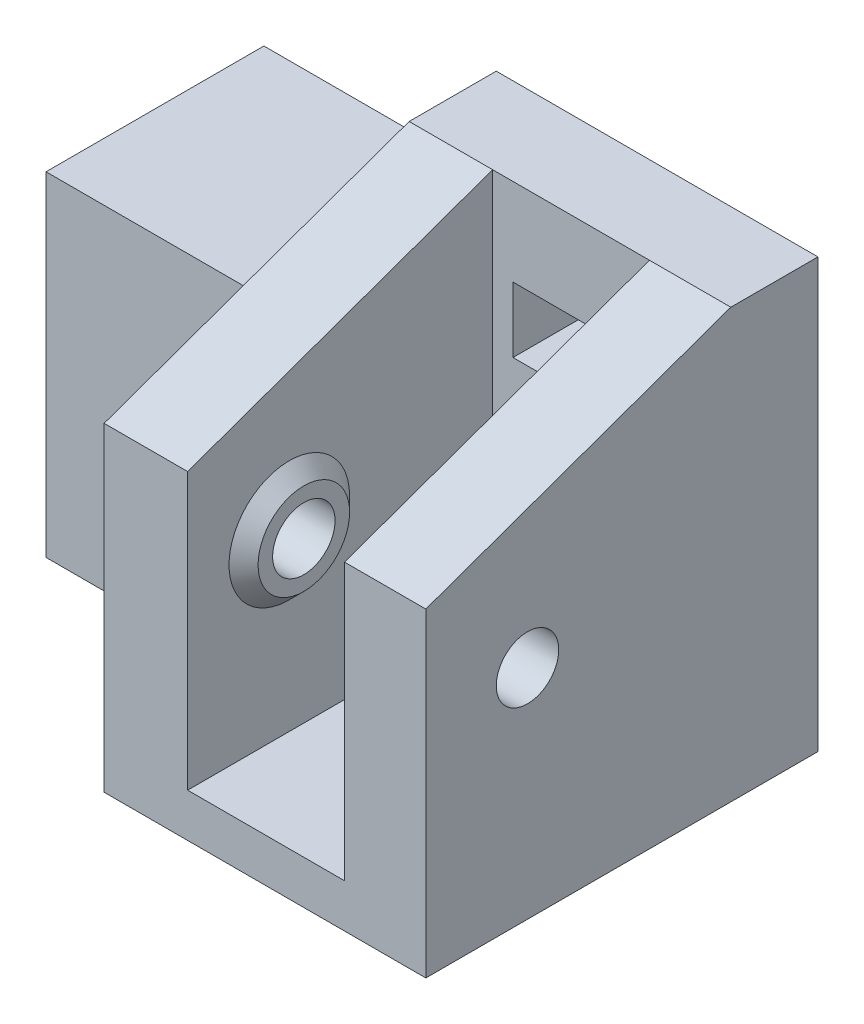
ISO-10303-21;
HEADER;
FILE_DESCRIPTION(('STEP AP214'),'2;1');
FILE_NAME('part.step','',(''),(''),'','','');
FILE_SCHEMA(('AUTOMOTIVE_DESIGN { 1 0 10303 214 1 1 1 1 }'));
ENDSEC;
DATA;
#1=APPLICATION_CONTEXT('core data for automotive mechanical design processes');
#2=APPLICATION_PROTOCOL_DEFINITION('international standard','automotive_design',2000,#1);
#3=PRODUCT_CONTEXT('',#1,'mechanical');
#4=PRODUCT('Part','Part','',(#3));
#5=PRODUCT_RELATED_PRODUCT_CATEGORY('part','',(#4));
#6=PRODUCT_DEFINITION_FORMATION('','',#4);
#7=PRODUCT_DEFINITION_CONTEXT('part definition',#1,'design');
#8=PRODUCT_DEFINITION('design','',#6,#7);
#9=PRODUCT_DEFINITION_SHAPE('','',#8);
#10=(LENGTH_UNIT() NAMED_UNIT(*) SI_UNIT(.MILLI.,.METRE.));
#11=(NAMED_UNIT(*) PLANE_ANGLE_UNIT() SI_UNIT($,.RADIAN.));
#12=(NAMED_UNIT(*) SI_UNIT($,.STERADIAN.) SOLID_ANGLE_UNIT());
#13=UNCERTAINTY_MEASURE_WITH_UNIT(LENGTH_MEASURE(1.E-05),#10,'distance_accuracy_value','');
#14=(GEOMETRIC_REPRESENTATION_CONTEXT(3) GLOBAL_UNCERTAINTY_ASSIGNED_CONTEXT((#13)) GLOBAL_UNIT_ASSIGNED_CONTEXT((#10,
#11,#12)) REPRESENTATION_CONTEXT('',''));
#15=CARTESIAN_POINT('',(0.,0.,0.));
#16=DIRECTION('',(0.,0.,1.));
#17=DIRECTION('',(1.,0.,0.));
#18=AXIS2_PLACEMENT_3D('',#15,#16,#17);
#19=CARTESIAN_POINT('',(13.75,0.,-10.));
#20=DIRECTION('',(-1.,0.,0.));
#21=DIRECTION('',(0.,0.,-1.));
#22=AXIS2_PLACEMENT_3D('',#19,#20,#21);
#23=PLANE('',#22);
#24=CARTESIAN_POINT('',(13.75,0.,0.));
#25=DIRECTION('',(1.,0.,0.));
#26=DIRECTION('',(0.,0.,-1.));
#27=AXIS2_PLACEMENT_3D('',#24,#25,#26);
#28=CIRCLE('',#27,4.14999999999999);
#29=CARTESIAN_POINT('',(13.75,0.,-4.14999999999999));
#30=VERTEX_POINT('',#29);
#31=EDGE_CURVE('E47',#30,#30,#28,.T.);
#32=ORIENTED_EDGE('',*,*,#31,.F.);
#33=EDGE_LOOP('',(#32));
#34=FACE_BOUND('',#33,.T.);
#35=DIRECTION('',(0.,1.,0.));
#36=VECTOR('',#35,1.);
#37=CARTESIAN_POINT('',(13.75,-15.,-14.));
#38=LINE('',#37,#36);
#39=CARTESIAN_POINT('',(13.75,-12.,-14.));
#40=VERTEX_POINT('',#39);
#41=CARTESIAN_POINT('',(13.75,14.5,-14.));
#42=VERTEX_POINT('',#41);
#43=EDGE_CURVE('E186',#40,#42,#38,.T.);
#44=ORIENTED_EDGE('',*,*,#43,.T.);
#45=DIRECTION('',(0.,-0.336336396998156,0.941741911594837));
#46=VECTOR('',#45,1.);
#47=CARTESIAN_POINT('',(13.75,14.5,-14.));
#48=LINE('',#47,#46);
#49=CARTESIAN_POINT('',(13.75,7.,7.));
#50=VERTEX_POINT('',#49);
#51=EDGE_CURVE('E340',#42,#50,#48,.T.);
#52=ORIENTED_EDGE('',*,*,#51,.T.);
#53=DIRECTION('',(0.,-1.,0.));
#54=VECTOR('',#53,1.);
#55=CARTESIAN_POINT('',(13.75,7.,7.));
#56=LINE('',#55,#54);
#57=CARTESIAN_POINT('',(13.75,-12.,7.00000000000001));
#58=VERTEX_POINT('',#57);
#59=EDGE_CURVE('E343',#50,#58,#56,.T.);
#60=ORIENTED_EDGE('',*,*,#59,.T.);
#61=DIRECTION('',(0.,0.,1.));
#62=VECTOR('',#61,1.);
#63=CARTESIAN_POINT('',(13.75,-12.,-14.));
#64=LINE('',#63,#62);
#65=EDGE_CURVE('E190',#40,#58,#64,.T.);
#66=ORIENTED_EDGE('',*,*,#65,.F.);
#67=EDGE_LOOP('',(#44,#52,#60,#66));
#68=FACE_BOUND('',#67,.T.);
#69=ADVANCED_FACE('F39',(#34,#68),#23,.F.);
#70=CARTESIAN_POINT('',(24.55,0.,-10.));
#71=DIRECTION('',(1.,0.,0.));
#72=DIRECTION('',(0.,0.,1.));
#73=AXIS2_PLACEMENT_3D('',#70,#71,#72);
#74=PLANE('',#73);
#75=CARTESIAN_POINT('',(24.55,0.,0.));
#76=DIRECTION('',(-1.,0.,0.));
#77=DIRECTION('',(0.,0.,1.));
#78=AXIS2_PLACEMENT_3D('',#75,#76,#77);
#79=CIRCLE('',#78,4.15);
#80=CARTESIAN_POINT('',(24.55,0.,4.15));
#81=VERTEX_POINT('',#80);
#82=EDGE_CURVE('E11',#81,#81,#79,.T.);
#83=ORIENTED_EDGE('',*,*,#82,.F.);
#84=EDGE_LOOP('',(#83));
#85=FACE_BOUND('',#84,.T.);
#86=DIRECTION('',(0.,1.,0.));
#87=VECTOR('',#86,1.);
#88=CARTESIAN_POINT('',(24.55,7.,7.));
#89=LINE('',#88,#87);
#90=CARTESIAN_POINT('',(24.55,-12.,7.00000000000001));
#91=VERTEX_POINT('',#90);
#92=CARTESIAN_POINT('',(24.55,7.,7.));
#93=VERTEX_POINT('',#92);
#94=EDGE_CURVE('E203',#91,#93,#89,.T.);
#95=ORIENTED_EDGE('',*,*,#94,.T.);
#96=DIRECTION('',(0.,0.336336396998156,-0.941741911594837));
#97=VECTOR('',#96,1.);
#98=CARTESIAN_POINT('',(24.55,14.5,-14.));
#99=LINE('',#98,#97);
#100=CARTESIAN_POINT('',(24.55,14.5,-14.));
#101=VERTEX_POINT('',#100);
#102=EDGE_CURVE('E202',#93,#101,#99,.T.);
#103=ORIENTED_EDGE('',*,*,#102,.T.);
#104=DIRECTION('',(0.,-1.,0.));
#105=VECTOR('',#104,1.);
#106=CARTESIAN_POINT('',(24.55,-15.,-14.));
#107=LINE('',#106,#105);
#108=CARTESIAN_POINT('',(24.55,-12.,-14.));
#109=VERTEX_POINT('',#108);
#110=EDGE_CURVE('E183',#101,#109,#107,.T.);
#111=ORIENTED_EDGE('',*,*,#110,.T.);
#112=DIRECTION('',(0.,0.,-1.));
#113=VECTOR('',#112,1.);
#114=CARTESIAN_POINT('',(24.55,-12.,-14.));
#115=LINE('',#114,#113);
#116=EDGE_CURVE('E191',#91,#109,#115,.T.);
#117=ORIENTED_EDGE('',*,*,#116,.F.);
#118=EDGE_LOOP('',(#95,#103,#111,#117));
#119=FACE_BOUND('',#118,.T.);
#120=ADVANCED_FACE('F200',(#85,#119),#74,.F.);
#121=CARTESIAN_POINT('',(0.,0.,-14.));
#122=DIRECTION('',(0.,0.,1.));
#123=DIRECTION('',(-1.,0.,0.));
#124=AXIS2_PLACEMENT_3D('',#121,#122,#123);
#125=PLANE('',#124);
#126=DIRECTION('',(-1.,0.,0.));
#127=VECTOR('',#126,1.);
#128=CARTESIAN_POINT('',(24.55,-12.,-14.));
#129=LINE('',#128,#127);
#130=EDGE_CURVE('E177',#109,#40,#129,.T.);
#131=ORIENTED_EDGE('',*,*,#130,.F.);
#132=ORIENTED_EDGE('',*,*,#110,.F.);
#133=DIRECTION('',(-1.,0.,0.));
#134=VECTOR('',#133,1.);
#135=CARTESIAN_POINT('',(8.,14.5,-14.));
#136=LINE('',#135,#134);
#137=EDGE_CURVE('E289',#101,#42,#136,.T.);
#138=ORIENTED_EDGE('',*,*,#137,.T.);
#139=ORIENTED_EDGE('',*,*,#43,.F.);
#140=EDGE_LOOP('',(#131,#132,#138,#139));
#141=FACE_BOUND('',#140,.T.);
#142=DIRECTION('',(0.,-1.,0.));
#143=VECTOR('',#142,1.);
#144=CARTESIAN_POINT('',(15.15,-4.,-14.));
#145=LINE('',#144,#143);
#146=CARTESIAN_POINT('',(15.15,-4.,-14.));
#147=VERTEX_POINT('',#146);
#148=CARTESIAN_POINT('',(15.15,-8.5,-14.));
#149=VERTEX_POINT('',#148);
#150=EDGE_CURVE('E222',#147,#149,#145,.T.);
#151=ORIENTED_EDGE('',*,*,#150,.F.);
#152=DIRECTION('',(-1.,0.,0.));
#153=VECTOR('',#152,1.);
#154=CARTESIAN_POINT('',(15.15,-4.,-14.));
#155=LINE('',#154,#153);
#156=CARTESIAN_POINT('',(23.15,-4.,-14.));
#157=VERTEX_POINT('',#156);
#158=EDGE_CURVE('E232',#157,#147,#155,.T.);
#159=ORIENTED_EDGE('',*,*,#158,.F.);
#160=DIRECTION('',(0.,1.,0.));
#161=VECTOR('',#160,1.);
#162=CARTESIAN_POINT('',(23.15,-4.,-14.));
#163=LINE('',#162,#161);
#164=CARTESIAN_POINT('',(23.15,-8.5,-14.));
#165=VERTEX_POINT('',#164);
#166=EDGE_CURVE('E229',#165,#157,#163,.T.);
#167=ORIENTED_EDGE('',*,*,#166,.F.);
#168=DIRECTION('',(1.,0.,0.));
#169=VECTOR('',#168,1.);
#170=CARTESIAN_POINT('',(15.15,-8.5,-14.));
#171=LINE('',#170,#169);
#172=EDGE_CURVE('E225',#149,#165,#171,.T.);
#173=ORIENTED_EDGE('',*,*,#172,.F.);
#174=EDGE_LOOP('',(#151,#159,#167,#173));
#175=FACE_BOUND('',#174,.T.);
#176=DIRECTION('',(0.,-1.,0.));
#177=VECTOR('',#176,1.);
#178=CARTESIAN_POINT('',(15.15,4.,-14.));
#179=LINE('',#178,#177);
#180=CARTESIAN_POINT('',(15.15,8.5,-14.));
#181=VERTEX_POINT('',#180);
#182=CARTESIAN_POINT('',(15.15,4.,-14.));
#183=VERTEX_POINT('',#182);
#184=EDGE_CURVE('E254',#181,#183,#179,.T.);
#185=ORIENTED_EDGE('',*,*,#184,.F.);
#186=DIRECTION('',(-1.,0.,0.));
#187=VECTOR('',#186,1.);
#188=CARTESIAN_POINT('',(15.15,8.5,-14.));
#189=LINE('',#188,#187);
#190=CARTESIAN_POINT('',(23.15,8.5,-14.));
#191=VERTEX_POINT('',#190);
#192=EDGE_CURVE('E264',#191,#181,#189,.T.);
#193=ORIENTED_EDGE('',*,*,#192,.F.);
#194=DIRECTION('',(0.,1.,0.));
#195=VECTOR('',#194,1.);
#196=CARTESIAN_POINT('',(23.15,4.,-14.));
#197=LINE('',#196,#195);
#198=CARTESIAN_POINT('',(23.15,4.,-14.));
#199=VERTEX_POINT('',#198);
#200=EDGE_CURVE('E261',#199,#191,#197,.T.);
#201=ORIENTED_EDGE('',*,*,#200,.F.);
#202=DIRECTION('',(1.,0.,0.));
#203=VECTOR('',#202,1.);
#204=CARTESIAN_POINT('',(15.15,4.,-14.));
#205=LINE('',#204,#203);
#206=EDGE_CURVE('E257',#183,#199,#205,.T.);
#207=ORIENTED_EDGE('',*,*,#206,.F.);
#208=EDGE_LOOP('',(#185,#193,#201,#207));
#209=FACE_BOUND('',#208,.T.);
#210=ADVANCED_FACE('F179',(#141,#175,#209),#125,.T.);
#211=CARTESIAN_POINT('',(0.,0.,-20.));
#212=DIRECTION('',(0.,0.,1.));
#213=DIRECTION('',(-1.,0.,0.));
#214=AXIS2_PLACEMENT_3D('',#211,#212,#213);
#215=PLANE('',#214);
#216=DIRECTION('',(1.,0.,0.));
#217=VECTOR('',#216,1.);
#218=CARTESIAN_POINT('',(8.,-15.,-20.));
#219=LINE('',#218,#217);
#220=CARTESIAN_POINT('',(-8.,-15.,-20.));
#221=VERTEX_POINT('',#220);
#222=CARTESIAN_POINT('',(30.15,-15.,-20.));
#223=VERTEX_POINT('',#222);
#224=EDGE_CURVE('E322',#221,#223,#219,.T.);
#225=ORIENTED_EDGE('',*,*,#224,.F.);
#226=DIRECTION('',(0.,-1.,0.));
#227=VECTOR('',#226,1.);
#228=CARTESIAN_POINT('',(-8.,8.,-20.));
#229=LINE('',#228,#227);
#230=CARTESIAN_POINT('',(-8.,8.,-20.));
#231=VERTEX_POINT('',#230);
#232=EDGE_CURVE('E320',#231,#221,#229,.T.);
#233=ORIENTED_EDGE('',*,*,#232,.F.);
#234=DIRECTION('',(-1.,0.,0.));
#235=VECTOR('',#234,1.);
#236=CARTESIAN_POINT('',(8.,8.,-20.));
#237=LINE('',#236,#235);
#238=CARTESIAN_POINT('',(8.,7.99999999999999,-20.));
#239=VERTEX_POINT('',#238);
#240=EDGE_CURVE('E316',#239,#231,#237,.T.);
#241=ORIENTED_EDGE('',*,*,#240,.F.);
#242=DIRECTION('',(0.,-1.,0.));
#243=VECTOR('',#242,1.);
#244=CARTESIAN_POINT('',(8.,-15.,-20.));
#245=LINE('',#244,#243);
#246=CARTESIAN_POINT('',(8.,14.5,-20.));
#247=VERTEX_POINT('',#246);
#248=EDGE_CURVE('E280',#247,#239,#245,.T.);
#249=ORIENTED_EDGE('',*,*,#248,.F.);
#250=DIRECTION('',(-1.,0.,0.));
#251=VECTOR('',#250,1.);
#252=CARTESIAN_POINT('',(8.,14.5,-20.));
#253=LINE('',#252,#251);
#254=CARTESIAN_POINT('',(30.15,14.5,-20.));
#255=VERTEX_POINT('',#254);
#256=EDGE_CURVE('E295',#255,#247,#253,.T.);
#257=ORIENTED_EDGE('',*,*,#256,.F.);
#258=DIRECTION('',(0.,1.,0.));
#259=VECTOR('',#258,1.);
#260=CARTESIAN_POINT('',(30.15,-15.,-20.));
#261=LINE('',#260,#259);
#262=EDGE_CURVE('E292',#223,#255,#261,.T.);
#263=ORIENTED_EDGE('',*,*,#262,.F.);
#264=EDGE_LOOP('',(#225,#233,#241,#249,#257,#263));
#265=FACE_BOUND('',#264,.T.);
#266=CARTESIAN_POINT('',(0.,0.,-20.));
#267=DIRECTION('',(0.,0.,1.));
#268=DIRECTION('',(1.,0.,0.));
#269=AXIS2_PLACEMENT_3D('',#266,#267,#268);
#270=CIRCLE('',#269,4.);
#271=CARTESIAN_POINT('',(4.,0.,-20.));
#272=VERTEX_POINT('',#271);
#273=EDGE_CURVE('E313',#272,#272,#270,.T.);
#274=ORIENTED_EDGE('',*,*,#273,.T.);
#275=EDGE_LOOP('',(#274));
#276=FACE_BOUND('',#275,.T.);
#277=DIRECTION('',(1.,0.,0.));
#278=VECTOR('',#277,1.);
#279=CARTESIAN_POINT('',(15.15,-8.5,-20.));
#280=LINE('',#279,#278);
#281=CARTESIAN_POINT('',(15.15,-8.5,-20.));
#282=VERTEX_POINT('',#281);
#283=CARTESIAN_POINT('',(23.15,-8.5,-20.));
#284=VERTEX_POINT('',#283);
#285=EDGE_CURVE('E238',#282,#284,#280,.T.);
#286=ORIENTED_EDGE('',*,*,#285,.T.);
#287=DIRECTION('',(0.,1.,0.));
#288=VECTOR('',#287,1.);
#289=CARTESIAN_POINT('',(23.15,-4.,-20.));
#290=LINE('',#289,#288);
#291=CARTESIAN_POINT('',(23.15,-4.,-20.));
#292=VERTEX_POINT('',#291);
#293=EDGE_CURVE('E241',#284,#292,#290,.T.);
#294=ORIENTED_EDGE('',*,*,#293,.T.);
#295=DIRECTION('',(-1.,0.,0.));
#296=VECTOR('',#295,1.);
#297=CARTESIAN_POINT('',(15.15,-4.,-20.));
#298=LINE('',#297,#296);
#299=CARTESIAN_POINT('',(15.15,-4.,-20.));
#300=VERTEX_POINT('',#299);
#301=EDGE_CURVE('E226',#292,#300,#298,.T.);
#302=ORIENTED_EDGE('',*,*,#301,.T.);
#303=DIRECTION('',(0.,-1.,0.));
#304=VECTOR('',#303,1.);
#305=CARTESIAN_POINT('',(15.15,-4.,-20.));
#306=LINE('',#305,#304);
#307=EDGE_CURVE('E219',#300,#282,#306,.T.);
#308=ORIENTED_EDGE('',*,*,#307,.T.);
#309=EDGE_LOOP('',(#286,#294,#302,#308));
#310=FACE_BOUND('',#309,.T.);
#311=DIRECTION('',(1.,0.,0.));
#312=VECTOR('',#311,1.);
#313=CARTESIAN_POINT('',(15.15,4.,-20.));
#314=LINE('',#313,#312);
#315=CARTESIAN_POINT('',(15.15,4.,-20.));
#316=VERTEX_POINT('',#315);
#317=CARTESIAN_POINT('',(23.15,4.,-20.));
#318=VERTEX_POINT('',#317);
#319=EDGE_CURVE('E270',#316,#318,#314,.T.);
#320=ORIENTED_EDGE('',*,*,#319,.T.);
#321=DIRECTION('',(0.,1.,0.));
#322=VECTOR('',#321,1.);
#323=CARTESIAN_POINT('',(23.15,4.,-20.));
#324=LINE('',#323,#322);
#325=CARTESIAN_POINT('',(23.15,8.5,-20.));
#326=VERTEX_POINT('',#325);
#327=EDGE_CURVE('E273',#318,#326,#324,.T.);
#328=ORIENTED_EDGE('',*,*,#327,.T.);
#329=DIRECTION('',(-1.,0.,0.));
#330=VECTOR('',#329,1.);
#331=CARTESIAN_POINT('',(15.15,8.5,-20.));
#332=LINE('',#331,#330);
#333=CARTESIAN_POINT('',(15.15,8.5,-20.));
#334=VERTEX_POINT('',#333);
#335=EDGE_CURVE('E258',#326,#334,#332,.T.);
#336=ORIENTED_EDGE('',*,*,#335,.T.);
#337=DIRECTION('',(0.,-1.,0.));
#338=VECTOR('',#337,1.);
#339=CARTESIAN_POINT('',(15.15,4.,-20.));
#340=LINE('',#339,#338);
#341=EDGE_CURVE('E248',#334,#316,#340,.T.);
#342=ORIENTED_EDGE('',*,*,#341,.T.);
#343=EDGE_LOOP('',(#320,#328,#336,#342));
#344=FACE_BOUND('',#343,.T.);
#345=ADVANCED_FACE('F394',(#265,#276,#310,#344),#215,.F.);
#346=CARTESIAN_POINT('',(8.,8.,-20.));
#347=DIRECTION('',(0.,-1.,0.));
#348=DIRECTION('',(0.,0.,1.));
#349=AXIS2_PLACEMENT_3D('',#346,#347,#348);
#350=PLANE('',#349);
#351=DIRECTION('',(0.,0.,1.));
#352=VECTOR('',#351,1.);
#353=CARTESIAN_POINT('',(8.,8.,-20.));
#354=LINE('',#353,#352);
#355=CARTESIAN_POINT('',(8.,8.,-5.));
#356=VERTEX_POINT('',#355);
#357=EDGE_CURVE('E326',#239,#356,#354,.T.);
#358=ORIENTED_EDGE('',*,*,#357,.F.);
#359=ORIENTED_EDGE('',*,*,#240,.T.);
#360=DIRECTION('',(0.,0.,1.));
#361=VECTOR('',#360,1.);
#362=CARTESIAN_POINT('',(-8.,8.,-20.));
#363=LINE('',#362,#361);
#364=CARTESIAN_POINT('',(-8.,8.,-5.));
#365=VERTEX_POINT('',#364);
#366=EDGE_CURVE('E61',#231,#365,#363,.T.);
#367=ORIENTED_EDGE('',*,*,#366,.T.);
#368=DIRECTION('',(1.,0.,0.));
#369=VECTOR('',#368,1.);
#370=CARTESIAN_POINT('',(-8.,8.,-5.));
#371=LINE('',#370,#369);
#372=EDGE_CURVE('E300',#365,#356,#371,.T.);
#373=ORIENTED_EDGE('',*,*,#372,.T.);
#374=EDGE_LOOP('',(#358,#359,#367,#373));
#375=FACE_BOUND('',#374,.T.);
#376=ADVANCED_FACE('F497',(#375),#350,.F.);
#377=CARTESIAN_POINT('',(-8.,8.,-20.));
#378=DIRECTION('',(1.,0.,0.));
#379=DIRECTION('',(0.,1.,0.));
#380=AXIS2_PLACEMENT_3D('',#377,#378,#379);
#381=PLANE('',#380);
#382=ORIENTED_EDGE('',*,*,#366,.F.);
#383=ORIENTED_EDGE('',*,*,#232,.T.);
#384=DIRECTION('',(0.,0.,1.));
#385=VECTOR('',#384,1.);
#386=CARTESIAN_POINT('',(-8.,-15.,-20.));
#387=LINE('',#386,#385);
#388=CARTESIAN_POINT('',(-8.,-15.,-5.));
#389=VERTEX_POINT('',#388);
#390=EDGE_CURVE('E54',#221,#389,#387,.T.);
#391=ORIENTED_EDGE('',*,*,#390,.T.);
#392=DIRECTION('',(0.,1.,0.));
#393=VECTOR('',#392,1.);
#394=CARTESIAN_POINT('',(-8.,-15.,-5.));
#395=LINE('',#394,#393);
#396=EDGE_CURVE('E310',#389,#365,#395,.T.);
#397=ORIENTED_EDGE('',*,*,#396,.T.);
#398=EDGE_LOOP('',(#382,#383,#391,#397));
#399=FACE_BOUND('',#398,.T.);
#400=ADVANCED_FACE('F500',(#399),#381,.F.);
#401=CARTESIAN_POINT('',(8.,-15.,-20.));
#402=DIRECTION('',(0.,1.,0.));
#403=DIRECTION('',(0.,0.,-1.));
#404=AXIS2_PLACEMENT_3D('',#401,#402,#403);
#405=PLANE('',#404);
#406=DIRECTION('',(0.,0.,-1.));
#407=VECTOR('',#406,1.);
#408=CARTESIAN_POINT('',(8.,-15.,7.00000000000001));
#409=LINE('',#408,#407);
#410=CARTESIAN_POINT('',(8.,-15.,7.00000000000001));
#411=VERTEX_POINT('',#410);
#412=CARTESIAN_POINT('',(8.,-15.,-5.));
#413=VERTEX_POINT('',#412);
#414=EDGE_CURVE('E341',#411,#413,#409,.T.);
#415=ORIENTED_EDGE('',*,*,#414,.T.);
#416=DIRECTION('',(-1.,0.,0.));
#417=VECTOR('',#416,1.);
#418=CARTESIAN_POINT('',(8.,-15.,-5.));
#419=LINE('',#418,#417);
#420=EDGE_CURVE('E308',#413,#389,#419,.T.);
#421=ORIENTED_EDGE('',*,*,#420,.T.);
#422=ORIENTED_EDGE('',*,*,#390,.F.);
#423=ORIENTED_EDGE('',*,*,#224,.T.);
#424=DIRECTION('',(0.,0.,-1.));
#425=VECTOR('',#424,1.);
#426=CARTESIAN_POINT('',(30.15,-15.,-14.));
#427=LINE('',#426,#425);
#428=CARTESIAN_POINT('',(30.15,-15.,7.00000000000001));
#429=VERTEX_POINT('',#428);
#430=EDGE_CURVE('E288',#429,#223,#427,.T.);
#431=ORIENTED_EDGE('',*,*,#430,.F.);
#432=DIRECTION('',(1.,0.,0.));
#433=VECTOR('',#432,1.);
#434=CARTESIAN_POINT('',(24.55,-15.,7.00000000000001));
#435=LINE('',#434,#433);
#436=EDGE_CURVE('E214',#411,#429,#435,.T.);
#437=ORIENTED_EDGE('',*,*,#436,.F.);
#438=EDGE_LOOP('',(#415,#421,#422,#423,#431,#437));
#439=FACE_BOUND('',#438,.T.);
#440=ADVANCED_FACE('F384',(#439),#405,.F.);
#441=CARTESIAN_POINT('',(0.,0.,-20.));
#442=DIRECTION('',(0.,0.,1.));
#443=DIRECTION('',(-1.,0.,0.));
#444=AXIS2_PLACEMENT_3D('',#441,#442,#443);
#445=CYLINDRICAL_SURFACE('',#444,4.);
#446=ORIENTED_EDGE('',*,*,#273,.F.);
#447=EDGE_LOOP('',(#446));
#448=FACE_BOUND('',#447,.T.);
#449=CARTESIAN_POINT('',(0.,0.,-10.));
#450=DIRECTION('',(0.,0.,1.));
#451=DIRECTION('',(1.,0.,0.));
#452=AXIS2_PLACEMENT_3D('',#449,#450,#451);
#453=CIRCLE('',#452,4.);
#454=CARTESIAN_POINT('',(4.,0.,-10.));
#455=VERTEX_POINT('',#454);
#456=EDGE_CURVE('E312',#455,#455,#453,.T.);
#457=ORIENTED_EDGE('',*,*,#456,.T.);
#458=EDGE_LOOP('',(#457));
#459=FACE_BOUND('',#458,.T.);
#460=ADVANCED_FACE('F490',(#448,#459),#445,.F.);
#461=CARTESIAN_POINT('',(0.,0.,-10.));
#462=DIRECTION('',(0.,0.,1.));
#463=DIRECTION('',(-1.,0.,0.));
#464=AXIS2_PLACEMENT_3D('',#461,#462,#463);
#465=PLANE('',#464);
#466=ORIENTED_EDGE('',*,*,#456,.F.);
#467=EDGE_LOOP('',(#466));
#468=FACE_BOUND('',#467,.T.);
#469=ADVANCED_FACE('F486',(#468),#465,.F.);
#470=CARTESIAN_POINT('',(0.,0.,-5.));
#471=DIRECTION('',(0.,0.,1.));
#472=DIRECTION('',(-1.,0.,0.));
#473=AXIS2_PLACEMENT_3D('',#470,#471,#472);
#474=PLANE('',#473);
#475=ORIENTED_EDGE('',*,*,#372,.F.);
#476=ORIENTED_EDGE('',*,*,#396,.F.);
#477=ORIENTED_EDGE('',*,*,#420,.F.);
#478=DIRECTION('',(0.,-1.,0.));
#479=VECTOR('',#478,1.);
#480=CARTESIAN_POINT('',(8.,8.,-5.));
#481=LINE('',#480,#479);
#482=EDGE_CURVE('E306',#356,#413,#481,.T.);
#483=ORIENTED_EDGE('',*,*,#482,.F.);
#484=EDGE_LOOP('',(#475,#476,#477,#483));
#485=FACE_BOUND('',#484,.T.);
#486=ADVANCED_FACE('F483',(#485),#474,.T.);
#487=CARTESIAN_POINT('',(8.,-15.,-14.));
#488=DIRECTION('',(-1.,0.,0.));
#489=DIRECTION('',(0.,0.,-1.));
#490=AXIS2_PLACEMENT_3D('',#487,#488,#489);
#491=PLANE('',#490);
#492=ORIENTED_EDGE('',*,*,#357,.T.);
#493=ORIENTED_EDGE('',*,*,#482,.T.);
#494=ORIENTED_EDGE('',*,*,#414,.F.);
#495=DIRECTION('',(0.,-1.,0.));
#496=VECTOR('',#495,1.);
#497=CARTESIAN_POINT('',(8.,6.99999999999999,7.));
#498=LINE('',#497,#496);
#499=CARTESIAN_POINT('',(7.99999999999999,7.,7.));
#500=VERTEX_POINT('',#499);
#501=EDGE_CURVE('E356',#500,#411,#498,.T.);
#502=ORIENTED_EDGE('',*,*,#501,.F.);
#503=DIRECTION('',(0.,-0.336336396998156,0.941741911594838));
#504=VECTOR('',#503,1.);
#505=CARTESIAN_POINT('',(8.,14.5,-14.));
#506=LINE('',#505,#504);
#507=CARTESIAN_POINT('',(8.,14.5,-14.));
#508=VERTEX_POINT('',#507);
#509=EDGE_CURVE('E346',#508,#500,#506,.T.);
#510=ORIENTED_EDGE('',*,*,#509,.F.);
#511=DIRECTION('',(0.,0.,-1.));
#512=VECTOR('',#511,1.);
#513=CARTESIAN_POINT('',(8.,14.5,-14.));
#514=LINE('',#513,#512);
#515=EDGE_CURVE('E298',#508,#247,#514,.T.);
#516=ORIENTED_EDGE('',*,*,#515,.T.);
#517=ORIENTED_EDGE('',*,*,#248,.T.);
#518=EDGE_LOOP('',(#492,#493,#494,#502,#510,#516,#517));
#519=FACE_BOUND('',#518,.T.);
#520=CARTESIAN_POINT('',(8.,0.,0.));
#521=DIRECTION('',(1.,0.,0.));
#522=DIRECTION('',(0.,-1.,0.));
#523=AXIS2_PLACEMENT_3D('',#520,#521,#522);
#524=CIRCLE('',#523,2.15);
#525=CARTESIAN_POINT('',(7.99999999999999,0.,2.15));
#526=VERTEX_POINT('',#525);
#527=EDGE_CURVE('E354',#526,#526,#524,.T.);
#528=ORIENTED_EDGE('',*,*,#527,.T.);
#529=EDGE_LOOP('',(#528));
#530=FACE_BOUND('',#529,.T.);
#531=ADVANCED_FACE('F379',(#519,#530),#491,.T.);
#532=CARTESIAN_POINT('',(8.,14.5,-14.));
#533=DIRECTION('',(0.,1.,0.));
#534=DIRECTION('',(0.,0.,-1.));
#535=AXIS2_PLACEMENT_3D('',#532,#533,#534);
#536=PLANE('',#535);
#537=ORIENTED_EDGE('',*,*,#256,.T.);
#538=ORIENTED_EDGE('',*,*,#515,.F.);
#539=DIRECTION('',(1.,0.,0.));
#540=VECTOR('',#539,1.);
#541=CARTESIAN_POINT('',(-28.2111861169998,14.5,-14.));
#542=LINE('',#541,#540);
#543=EDGE_CURVE('E353',#508,#42,#542,.T.);
#544=ORIENTED_EDGE('',*,*,#543,.T.);
#545=ORIENTED_EDGE('',*,*,#137,.F.);
#546=CARTESIAN_POINT('',(30.15,14.5,-14.));
#547=VERTEX_POINT('',#546);
#548=EDGE_CURVE('E286',#547,#101,#136,.T.);
#549=ORIENTED_EDGE('',*,*,#548,.F.);
#550=DIRECTION('',(0.,0.,-1.));
#551=VECTOR('',#550,1.);
#552=CARTESIAN_POINT('',(30.15,14.5,-14.));
#553=LINE('',#552,#551);
#554=EDGE_CURVE('E301',#547,#255,#553,.T.);
#555=ORIENTED_EDGE('',*,*,#554,.T.);
#556=EDGE_LOOP('',(#537,#538,#544,#545,#549,#555));
#557=FACE_BOUND('',#556,.T.);
#558=ADVANCED_FACE('F400',(#557),#536,.T.);
#559=CARTESIAN_POINT('',(30.15,-15.,-14.));
#560=DIRECTION('',(1.,0.,0.));
#561=DIRECTION('',(0.,0.,1.));
#562=AXIS2_PLACEMENT_3D('',#559,#560,#561);
#563=PLANE('',#562);
#564=ORIENTED_EDGE('',*,*,#262,.T.);
#565=ORIENTED_EDGE('',*,*,#554,.F.);
#566=DIRECTION('',(0.,0.336336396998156,-0.941741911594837));
#567=VECTOR('',#566,1.);
#568=CARTESIAN_POINT('',(30.15,14.5,-14.));
#569=LINE('',#568,#567);
#570=CARTESIAN_POINT('',(30.15,7.,7.));
#571=VERTEX_POINT('',#570);
#572=EDGE_CURVE('E204',#571,#547,#569,.T.);
#573=ORIENTED_EDGE('',*,*,#572,.F.);
#574=DIRECTION('',(0.,1.,0.));
#575=VECTOR('',#574,1.);
#576=CARTESIAN_POINT('',(30.15,7.,7.));
#577=LINE('',#576,#575);
#578=EDGE_CURVE('E207',#429,#571,#577,.T.);
#579=ORIENTED_EDGE('',*,*,#578,.F.);
#580=ORIENTED_EDGE('',*,*,#430,.T.);
#581=EDGE_LOOP('',(#564,#565,#573,#579,#580));
#582=FACE_BOUND('',#581,.T.);
#583=CARTESIAN_POINT('',(30.15,0.,0.));
#584=DIRECTION('',(-1.,0.,0.));
#585=DIRECTION('',(0.,0.,1.));
#586=AXIS2_PLACEMENT_3D('',#583,#584,#585);
#587=CIRCLE('',#586,2.15);
#588=CARTESIAN_POINT('',(30.15,0.,2.15));
#589=VERTEX_POINT('',#588);
#590=EDGE_CURVE('E210',#589,#589,#587,.T.);
#591=ORIENTED_EDGE('',*,*,#590,.T.);
#592=EDGE_LOOP('',(#591));
#593=FACE_BOUND('',#592,.T.);
#594=ADVANCED_FACE('F388',(#582,#593),#563,.T.);
#595=CARTESIAN_POINT('',(15.15,4.,-14.));
#596=DIRECTION('',(-1.,0.,0.));
#597=DIRECTION('',(0.,0.,-1.));
#598=AXIS2_PLACEMENT_3D('',#595,#596,#597);
#599=PLANE('',#598);
#600=ORIENTED_EDGE('',*,*,#341,.F.);
#601=DIRECTION('',(0.,0.,-1.));
#602=VECTOR('',#601,1.);
#603=CARTESIAN_POINT('',(15.15,8.5,-14.));
#604=LINE('',#603,#602);
#605=EDGE_CURVE('E278',#181,#334,#604,.T.);
#606=ORIENTED_EDGE('',*,*,#605,.F.);
#607=ORIENTED_EDGE('',*,*,#184,.T.);
#608=DIRECTION('',(0.,0.,-1.));
#609=VECTOR('',#608,1.);
#610=CARTESIAN_POINT('',(15.15,4.,-14.));
#611=LINE('',#610,#609);
#612=EDGE_CURVE('E267',#183,#316,#611,.T.);
#613=ORIENTED_EDGE('',*,*,#612,.T.);
#614=EDGE_LOOP('',(#600,#606,#607,#613));
#615=FACE_BOUND('',#614,.T.);
#616=ADVANCED_FACE('F464',(#615),#599,.F.);
#617=CARTESIAN_POINT('',(15.15,8.5,-14.));
#618=DIRECTION('',(0.,1.,0.));
#619=DIRECTION('',(0.,0.,-1.));
#620=AXIS2_PLACEMENT_3D('',#617,#618,#619);
#621=PLANE('',#620);
#622=ORIENTED_EDGE('',*,*,#335,.F.);
#623=DIRECTION('',(0.,0.,-1.));
#624=VECTOR('',#623,1.);
#625=CARTESIAN_POINT('',(23.15,8.5,-14.));
#626=LINE('',#625,#624);
#627=EDGE_CURVE('E281',#191,#326,#626,.T.);
#628=ORIENTED_EDGE('',*,*,#627,.F.);
#629=ORIENTED_EDGE('',*,*,#192,.T.);
#630=ORIENTED_EDGE('',*,*,#605,.T.);
#631=EDGE_LOOP('',(#622,#628,#629,#630));
#632=FACE_BOUND('',#631,.T.);
#633=ADVANCED_FACE('F460',(#632),#621,.F.);
#634=CARTESIAN_POINT('',(23.15,4.,-14.));
#635=DIRECTION('',(1.,0.,0.));
#636=DIRECTION('',(0.,0.,1.));
#637=AXIS2_PLACEMENT_3D('',#634,#635,#636);
#638=PLANE('',#637);
#639=ORIENTED_EDGE('',*,*,#327,.F.);
#640=DIRECTION('',(0.,0.,-1.));
#641=VECTOR('',#640,1.);
#642=CARTESIAN_POINT('',(23.15,4.,-14.));
#643=LINE('',#642,#641);
#644=EDGE_CURVE('E283',#199,#318,#643,.T.);
#645=ORIENTED_EDGE('',*,*,#644,.F.);
#646=ORIENTED_EDGE('',*,*,#200,.T.);
#647=ORIENTED_EDGE('',*,*,#627,.T.);
#648=EDGE_LOOP('',(#639,#645,#646,#647));
#649=FACE_BOUND('',#648,.T.);
#650=ADVANCED_FACE('F463',(#649),#638,.F.);
#651=CARTESIAN_POINT('',(15.15,4.,-14.));
#652=DIRECTION('',(0.,-1.,0.));
#653=DIRECTION('',(0.,0.,1.));
#654=AXIS2_PLACEMENT_3D('',#651,#652,#653);
#655=PLANE('',#654);
#656=ORIENTED_EDGE('',*,*,#319,.F.);
#657=ORIENTED_EDGE('',*,*,#612,.F.);
#658=ORIENTED_EDGE('',*,*,#206,.T.);
#659=ORIENTED_EDGE('',*,*,#644,.T.);
#660=EDGE_LOOP('',(#656,#657,#658,#659));
#661=FACE_BOUND('',#660,.T.);
#662=ADVANCED_FACE('F458',(#661),#655,.F.);
#663=CARTESIAN_POINT('',(15.15,-4.,-14.));
#664=DIRECTION('',(-1.,0.,0.));
#665=DIRECTION('',(0.,-1.,0.));
#666=AXIS2_PLACEMENT_3D('',#663,#664,#665);
#667=PLANE('',#666);
#668=ORIENTED_EDGE('',*,*,#307,.F.);
#669=DIRECTION('',(0.,0.,-1.));
#670=VECTOR('',#669,1.);
#671=CARTESIAN_POINT('',(15.15,-4.,-14.));
#672=LINE('',#671,#670);
#673=EDGE_CURVE('E246',#147,#300,#672,.T.);
#674=ORIENTED_EDGE('',*,*,#673,.F.);
#675=ORIENTED_EDGE('',*,*,#150,.T.);
#676=DIRECTION('',(0.,0.,-1.));
#677=VECTOR('',#676,1.);
#678=CARTESIAN_POINT('',(15.15,-8.5,-14.));
#679=LINE('',#678,#677);
#680=EDGE_CURVE('E235',#149,#282,#679,.T.);
#681=ORIENTED_EDGE('',*,*,#680,.T.);
#682=EDGE_LOOP('',(#668,#674,#675,#681));
#683=FACE_BOUND('',#682,.T.);
#684=ADVANCED_FACE('F448',(#683),#667,.F.);
#685=CARTESIAN_POINT('',(15.15,-4.,-14.));
#686=DIRECTION('',(0.,1.,0.));
#687=DIRECTION('',(0.,0.,-1.));
#688=AXIS2_PLACEMENT_3D('',#685,#686,#687);
#689=PLANE('',#688);
#690=ORIENTED_EDGE('',*,*,#301,.F.);
#691=DIRECTION('',(0.,0.,-1.));
#692=VECTOR('',#691,1.);
#693=CARTESIAN_POINT('',(23.15,-4.,-14.));
#694=LINE('',#693,#692);
#695=EDGE_CURVE('E249',#157,#292,#694,.T.);
#696=ORIENTED_EDGE('',*,*,#695,.F.);
#697=ORIENTED_EDGE('',*,*,#158,.T.);
#698=ORIENTED_EDGE('',*,*,#673,.T.);
#699=EDGE_LOOP('',(#690,#696,#697,#698));
#700=FACE_BOUND('',#699,.T.);
#701=ADVANCED_FACE('F444',(#700),#689,.F.);
#702=CARTESIAN_POINT('',(23.15,-4.,-14.));
#703=DIRECTION('',(1.,0.,0.));
#704=DIRECTION('',(0.,1.,0.));
#705=AXIS2_PLACEMENT_3D('',#702,#703,#704);
#706=PLANE('',#705);
#707=ORIENTED_EDGE('',*,*,#293,.F.);
#708=DIRECTION('',(0.,0.,-1.));
#709=VECTOR('',#708,1.);
#710=CARTESIAN_POINT('',(23.15,-8.5,-14.));
#711=LINE('',#710,#709);
#712=EDGE_CURVE('E251',#165,#284,#711,.T.);
#713=ORIENTED_EDGE('',*,*,#712,.F.);
#714=ORIENTED_EDGE('',*,*,#166,.T.);
#715=ORIENTED_EDGE('',*,*,#695,.T.);
#716=EDGE_LOOP('',(#707,#713,#714,#715));
#717=FACE_BOUND('',#716,.T.);
#718=ADVANCED_FACE('F447',(#717),#706,.F.);
#719=CARTESIAN_POINT('',(15.15,-8.5,-14.));
#720=DIRECTION('',(0.,-1.,0.));
#721=DIRECTION('',(0.,0.,1.));
#722=AXIS2_PLACEMENT_3D('',#719,#720,#721);
#723=PLANE('',#722);
#724=ORIENTED_EDGE('',*,*,#285,.F.);
#725=ORIENTED_EDGE('',*,*,#680,.F.);
#726=ORIENTED_EDGE('',*,*,#172,.T.);
#727=ORIENTED_EDGE('',*,*,#712,.T.);
#728=EDGE_LOOP('',(#724,#725,#726,#727));
#729=FACE_BOUND('',#728,.T.);
#730=ADVANCED_FACE('F441',(#729),#723,.F.);
#731=CARTESIAN_POINT('',(24.55,14.5,-14.));
#732=DIRECTION('',(0.,0.941741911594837,0.336336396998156));
#733=DIRECTION('',(0.,0.336336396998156,-0.941741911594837));
#734=AXIS2_PLACEMENT_3D('',#731,#732,#733);
#735=PLANE('',#734);
#736=ORIENTED_EDGE('',*,*,#572,.T.);
#737=ORIENTED_EDGE('',*,*,#548,.T.);
#738=ORIENTED_EDGE('',*,*,#102,.F.);
#739=DIRECTION('',(1.,0.,0.));
#740=VECTOR('',#739,1.);
#741=CARTESIAN_POINT('',(24.55,7.,7.));
#742=LINE('',#741,#740);
#743=EDGE_CURVE('E217',#93,#571,#742,.T.);
#744=ORIENTED_EDGE('',*,*,#743,.T.);
#745=EDGE_LOOP('',(#736,#737,#738,#744));
#746=FACE_BOUND('',#745,.T.);
#747=ADVANCED_FACE('F404',(#746),#735,.T.);
#748=CARTESIAN_POINT('',(24.55,7.,7.));
#749=DIRECTION('',(0.,0.,1.));
#750=DIRECTION('',(0.,1.,0.));
#751=AXIS2_PLACEMENT_3D('',#748,#749,#750);
#752=PLANE('',#751);
#753=ORIENTED_EDGE('',*,*,#578,.T.);
#754=ORIENTED_EDGE('',*,*,#743,.F.);
#755=ORIENTED_EDGE('',*,*,#94,.F.);
#756=DIRECTION('',(1.,0.,0.));
#757=VECTOR('',#756,1.);
#758=CARTESIAN_POINT('',(24.55,-12.,7.00000000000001));
#759=LINE('',#758,#757);
#760=EDGE_CURVE('E195',#58,#91,#759,.T.);
#761=ORIENTED_EDGE('',*,*,#760,.F.);
#762=ORIENTED_EDGE('',*,*,#59,.F.);
#763=DIRECTION('',(1.,0.,0.));
#764=VECTOR('',#763,1.);
#765=CARTESIAN_POINT('',(-28.2111861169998,7.,7.));
#766=LINE('',#765,#764);
#767=EDGE_CURVE('E351',#500,#50,#766,.T.);
#768=ORIENTED_EDGE('',*,*,#767,.F.);
#769=ORIENTED_EDGE('',*,*,#501,.T.);
#770=ORIENTED_EDGE('',*,*,#436,.T.);
#771=EDGE_LOOP('',(#753,#754,#755,#761,#762,#768,#769,#770));
#772=FACE_BOUND('',#771,.T.);
#773=ADVANCED_FACE('F382',(#772),#752,.T.);
#774=CARTESIAN_POINT('',(24.55,0.,0.));
#775=DIRECTION('',(1.,0.,0.));
#776=DIRECTION('',(0.,0.,1.));
#777=AXIS2_PLACEMENT_3D('',#774,#775,#776);
#778=CYLINDRICAL_SURFACE('',#777,2.15);
#779=ORIENTED_EDGE('',*,*,#590,.F.);
#780=EDGE_LOOP('',(#779));
#781=FACE_BOUND('',#780,.T.);
#782=CARTESIAN_POINT('',(23.55,0.,0.));
#783=DIRECTION('',(1.,0.,0.));
#784=DIRECTION('',(0.,0.,-1.));
#785=AXIS2_PLACEMENT_3D('',#782,#783,#784);
#786=CIRCLE('',#785,2.15);
#787=CARTESIAN_POINT('',(23.55,0.,-2.15));
#788=VERTEX_POINT('',#787);
#789=EDGE_CURVE('E362',#788,#788,#786,.T.);
#790=ORIENTED_EDGE('',*,*,#789,.F.);
#791=EDGE_LOOP('',(#790));
#792=FACE_BOUND('',#791,.T.);
#793=ADVANCED_FACE('F430',(#781,#792),#778,.F.);
#794=CARTESIAN_POINT('',(-28.2111861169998,14.5,-14.));
#795=DIRECTION('',(0.,-0.941741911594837,-0.336336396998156));
#796=DIRECTION('',(0.,-0.336336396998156,0.941741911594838));
#797=AXIS2_PLACEMENT_3D('',#794,#795,#796);
#798=PLANE('',#797);
#799=ORIENTED_EDGE('',*,*,#509,.T.);
#800=ORIENTED_EDGE('',*,*,#767,.T.);
#801=ORIENTED_EDGE('',*,*,#51,.F.);
#802=ORIENTED_EDGE('',*,*,#543,.F.);
#803=EDGE_LOOP('',(#799,#800,#801,#802));
#804=FACE_BOUND('',#803,.T.);
#805=ADVANCED_FACE('F374',(#804),#798,.F.);
#806=CARTESIAN_POINT('',(-28.2111861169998,0.,0.));
#807=DIRECTION('',(1.,0.,0.));
#808=DIRECTION('',(0.,0.,1.));
#809=AXIS2_PLACEMENT_3D('',#806,#807,#808);
#810=CYLINDRICAL_SURFACE('',#809,2.15);
#811=CARTESIAN_POINT('',(14.75,0.,0.));
#812=DIRECTION('',(-1.,0.,0.));
#813=DIRECTION('',(0.,0.,1.));
#814=AXIS2_PLACEMENT_3D('',#811,#812,#813);
#815=CIRCLE('',#814,2.15);
#816=CARTESIAN_POINT('',(14.75,0.,2.15));
#817=VERTEX_POINT('',#816);
#818=EDGE_CURVE('E405',#817,#817,#815,.T.);
#819=CARTESIAN_POINT('',(7.99999999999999,0.,2.15));
#820=CARTESIAN_POINT('',(8.07031249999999,0.,2.15));
#821=CARTESIAN_POINT('',(8.14062499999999,0.,2.15));
#822=CARTESIAN_POINT('',(8.28124999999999,0.,2.15));
#823=CARTESIAN_POINT('',(8.35156249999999,0.,2.15));
#824=CARTESIAN_POINT('',(8.4921875,0.,2.15));
#825=CARTESIAN_POINT('',(8.56249999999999,0.,2.15));
#826=CARTESIAN_POINT('',(8.703125,0.,2.15));
#827=CARTESIAN_POINT('',(8.7734375,0.,2.15));
#828=CARTESIAN_POINT('',(8.91406249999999,0.,2.15));
#829=CARTESIAN_POINT('',(8.98437499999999,0.,2.15));
#830=CARTESIAN_POINT('',(9.12499999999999,0.,2.15));
#831=CARTESIAN_POINT('',(9.19531249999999,0.,2.15));
#832=CARTESIAN_POINT('',(9.33593749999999,0.,2.15));
#833=CARTESIAN_POINT('',(9.40624999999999,0.,2.15));
#834=CARTESIAN_POINT('',(9.54687499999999,0.,2.15));
#835=CARTESIAN_POINT('',(9.61718749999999,0.,2.15));
#836=CARTESIAN_POINT('',(9.7578125,0.,2.15));
#837=CARTESIAN_POINT('',(9.82812499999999,0.,2.15));
#838=CARTESIAN_POINT('',(9.96875,0.,2.15));
#839=CARTESIAN_POINT('',(10.0390625,0.,2.15));
#840=CARTESIAN_POINT('',(10.1796875,0.,2.15));
#841=CARTESIAN_POINT('',(10.25,0.,2.15));
#842=CARTESIAN_POINT('',(10.390625,0.,2.15));
#843=CARTESIAN_POINT('',(10.4609375,0.,2.15));
#844=CARTESIAN_POINT('',(10.6015625,0.,2.15));
#845=CARTESIAN_POINT('',(10.671875,0.,2.15));
#846=CARTESIAN_POINT('',(10.8125,0.,2.15));
#847=CARTESIAN_POINT('',(10.8828125,0.,2.15));
#848=CARTESIAN_POINT('',(11.0234375,0.,2.15));
#849=CARTESIAN_POINT('',(11.09375,0.,2.15));
#850=CARTESIAN_POINT('',(11.234375,0.,2.15));
#851=CARTESIAN_POINT('',(11.3046875,0.,2.15));
#852=CARTESIAN_POINT('',(11.4453125,0.,2.15));
#853=CARTESIAN_POINT('',(11.515625,0.,2.15));
#854=CARTESIAN_POINT('',(11.65625,0.,2.15));
#855=CARTESIAN_POINT('',(11.7265625,0.,2.15));
#856=CARTESIAN_POINT('',(11.8671875,0.,2.15));
#857=CARTESIAN_POINT('',(11.9375,0.,2.15));
#858=CARTESIAN_POINT('',(12.078125,0.,2.15));
#859=CARTESIAN_POINT('',(12.1484375,0.,2.15));
#860=CARTESIAN_POINT('',(12.2890625,0.,2.15));
#861=CARTESIAN_POINT('',(12.359375,0.,2.15));
#862=CARTESIAN_POINT('',(12.5,0.,2.15));
#863=CARTESIAN_POINT('',(12.5703125,0.,2.15));
#864=CARTESIAN_POINT('',(12.7109375,0.,2.15));
#865=CARTESIAN_POINT('',(12.78125,0.,2.15));
#866=CARTESIAN_POINT('',(12.921875,0.,2.15));
#867=CARTESIAN_POINT('',(12.9921875,0.,2.15));
#868=CARTESIAN_POINT('',(13.1328125,0.,2.15));
#869=CARTESIAN_POINT('',(13.203125,0.,2.15));
#870=CARTESIAN_POINT('',(13.34375,0.,2.15));
#871=CARTESIAN_POINT('',(13.4140625,0.,2.15));
#872=CARTESIAN_POINT('',(13.5546875,0.,2.15));
#873=CARTESIAN_POINT('',(13.625,0.,2.15));
#874=CARTESIAN_POINT('',(13.765625,0.,2.15));
#875=CARTESIAN_POINT('',(13.8359375,0.,2.15));
#876=CARTESIAN_POINT('',(13.9765625,0.,2.15));
#877=CARTESIAN_POINT('',(14.046875,0.,2.15));
#878=CARTESIAN_POINT('',(14.1875,0.,2.15));
#879=CARTESIAN_POINT('',(14.2578125,0.,2.15));
#880=CARTESIAN_POINT('',(14.3984375,0.,2.15));
#881=CARTESIAN_POINT('',(14.46875,0.,2.15));
#882=CARTESIAN_POINT('',(14.609375,0.,2.15));
#883=CARTESIAN_POINT('',(14.6796875,0.,2.15));
#884=CARTESIAN_POINT('',(14.75,0.,2.15));
#885=B_SPLINE_CURVE_WITH_KNOTS('',3,(#819,#820,#821,#822,#823,#824,#825,#826,#827,#828,#829,
#830,#831,#832,#833,#834,#835,#836,#837,#838,#839,#840,#841,#842,#843,#844,#845,#846,#847,#848,
#849,#850,#851,#852,#853,#854,#855,#856,#857,#858,#859,#860,#861,#862,#863,#864,#865,#866,#867,
#868,#869,#870,#871,#872,#873,#874,#875,#876,#877,#878,#879,#880,#881,#882,#883,#884),
.UNSPECIFIED.,.F.,.F.,(4,2,2,2,2,2,2,2,2,2,2,2,2,2,2,2,2,2,2,2,2,2,2,2,2,2,2,2,2,2,2,2,4),(0.,
0.210937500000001,0.421875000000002,0.632812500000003,0.843750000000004,1.0546875,1.265625,
1.4765625,1.6875,1.8984375,2.109375,2.3203125,2.53125,2.7421875,2.953125,3.1640625,3.375,
3.5859375,3.79687500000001,4.00781250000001,4.21875000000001,4.4296875,4.640625,4.8515625,
5.0625,5.27343750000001,5.48437500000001,5.69531250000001,5.90625,6.1171875,6.328125,
6.53906250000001,6.75000000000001),.UNSPECIFIED.);
#886=EDGE_CURVE('BSEAM420',#526,#817,#885,.T.);
#887=ORIENTED_EDGE('',*,*,#527,.F.);
#888=ORIENTED_EDGE('',*,*,#818,.F.);
#889=ORIENTED_EDGE('',*,*,#886,.T.);
#890=ORIENTED_EDGE('',*,*,#886,.F.);
#891=EDGE_LOOP('',(#887,#889,#888,#890));
#892=FACE_BOUND('',#891,.T.);
#893=ADVANCED_FACE('F420',(#892),#810,.F.);
#894=CARTESIAN_POINT('',(23.55,0.,0.));
#895=DIRECTION('',(-1.,0.,0.));
#896=DIRECTION('',(0.,0.,-1.));
#897=AXIS2_PLACEMENT_3D('',#894,#895,#896);
#898=PLANE('',#897);
#899=CARTESIAN_POINT('',(23.55,0.,0.));
#900=DIRECTION('',(1.,0.,0.));
#901=DIRECTION('',(0.,0.,-1.));
#902=AXIS2_PLACEMENT_3D('',#899,#900,#901);
#903=CIRCLE('',#902,3.15);
#904=CARTESIAN_POINT('',(23.55,0.,-3.15));
#905=VERTEX_POINT('',#904);
#906=EDGE_CURVE('E357',#905,#905,#903,.T.);
#907=ORIENTED_EDGE('',*,*,#906,.F.);
#908=EDGE_LOOP('',(#907));
#909=FACE_BOUND('',#908,.T.);
#910=ORIENTED_EDGE('',*,*,#789,.T.);
#911=EDGE_LOOP('',(#910));
#912=FACE_BOUND('',#911,.T.);
#913=ADVANCED_FACE('F416',(#909,#912),#898,.T.);
#914=CARTESIAN_POINT('',(14.75,0.,0.));
#915=DIRECTION('',(1.,0.,0.));
#916=DIRECTION('',(0.,0.,1.));
#917=AXIS2_PLACEMENT_3D('',#914,#915,#916);
#918=PLANE('',#917);
#919=CARTESIAN_POINT('',(14.75,0.,0.));
#920=DIRECTION('',(-1.,0.,0.));
#921=DIRECTION('',(0.,0.,1.));
#922=AXIS2_PLACEMENT_3D('',#919,#920,#921);
#923=CIRCLE('',#922,3.15);
#924=CARTESIAN_POINT('',(14.75,0.,3.15));
#925=VERTEX_POINT('',#924);
#926=EDGE_CURVE('E367',#925,#925,#923,.T.);
#927=ORIENTED_EDGE('',*,*,#926,.F.);
#928=EDGE_LOOP('',(#927));
#929=FACE_BOUND('',#928,.T.);
#930=ORIENTED_EDGE('',*,*,#818,.T.);
#931=EDGE_LOOP('',(#930));
#932=FACE_BOUND('',#931,.T.);
#933=ADVANCED_FACE('F413',(#929,#932),#918,.T.);
#934=CARTESIAN_POINT('',(14.75,0.,0.));
#935=DIRECTION('',(-1.,0.,0.));
#936=DIRECTION('',(0.,0.,-1.));
#937=AXIS2_PLACEMENT_3D('',#934,#935,#936);
#938=CONICAL_SURFACE('',#937,3.15,0.785398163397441);
#939=ORIENTED_EDGE('',*,*,#31,.T.);
#940=EDGE_LOOP('',(#939));
#941=FACE_BOUND('',#940,.T.);
#942=ORIENTED_EDGE('',*,*,#926,.T.);
#943=EDGE_LOOP('',(#942));
#944=FACE_BOUND('',#943,.T.);
#945=ADVANCED_FACE('F331',(#941,#944),#938,.T.);
#946=CARTESIAN_POINT('',(23.55,0.,0.));
#947=DIRECTION('',(1.,0.,0.));
#948=DIRECTION('',(0.,0.,1.));
#949=AXIS2_PLACEMENT_3D('',#946,#947,#948);
#950=CONICAL_SURFACE('',#949,3.15,0.785398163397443);
#951=ORIENTED_EDGE('',*,*,#82,.T.);
#952=EDGE_LOOP('',(#951));
#953=FACE_BOUND('',#952,.T.);
#954=ORIENTED_EDGE('',*,*,#906,.T.);
#955=EDGE_LOOP('',(#954));
#956=FACE_BOUND('',#955,.T.);
#957=ADVANCED_FACE('F41',(#953,#956),#950,.T.);
#958=CARTESIAN_POINT('',(0.,-12.,-10.));
#959=DIRECTION('',(0.,1.,0.));
#960=DIRECTION('',(0.,0.,-1.));
#961=AXIS2_PLACEMENT_3D('',#958,#959,#960);
#962=PLANE('',#961);
#963=ORIENTED_EDGE('',*,*,#116,.T.);
#964=ORIENTED_EDGE('',*,*,#130,.T.);
#965=ORIENTED_EDGE('',*,*,#65,.T.);
#966=ORIENTED_EDGE('',*,*,#760,.T.);
#967=EDGE_LOOP('',(#963,#964,#965,#966));
#968=FACE_BOUND('',#967,.T.);
#969=ADVANCED_FACE('F194',(#968),#962,.T.);
#970=CLOSED_SHELL('',(#69,#120,#210,#345,#376,#400,#440,#460,#469,#486,#531,#558,#594,#616,#633,
#650,#662,#684,#701,#718,#730,#747,#773,#793,#805,#893,#913,#933,#945,#957,#969));
#971=MANIFOLD_SOLID_BREP('B2',#970);
#972=ADVANCED_BREP_SHAPE_REPRESENTATION('',(#18,#971),#14);
#973=SHAPE_DEFINITION_REPRESENTATION(#9,#972);
ENDSEC;
END-ISO-10303-21;
